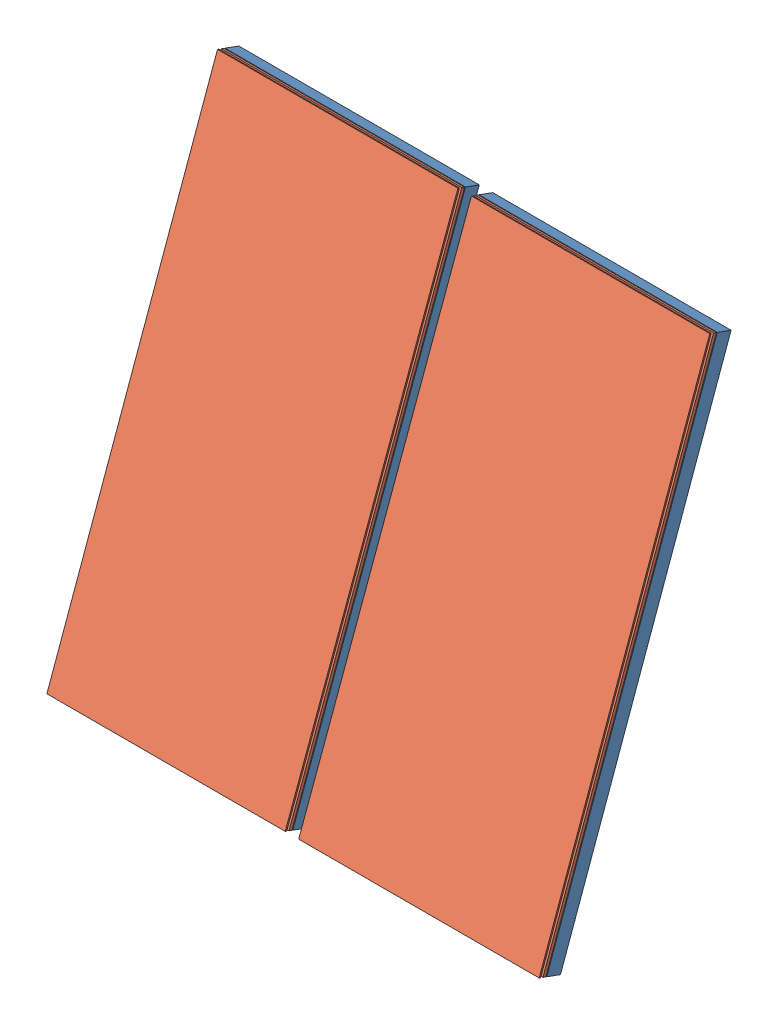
SolidWorks assembly Assem2.SLDASM, configuration Standard (file format 4400). Lengths in mm.
Overall size (3194 3181.3 2952.71).
6 component instances, 2 part files, 3 mates.
Components (placement in the parent):
- Assem1-1: Assem1.SLDASM [Standard] at origin size (1621.57 3104.27 1249.7)
  - Steelframe-1: Steelframe.SLDPRT [Standard] at origin size (1557 3086.49 1200.83)
  - Glass-1: Glass.sldprt [Default] at origin size (1557 3069.73 1154.79)
- Assem1-2: Assem1.SLDASM [Standard] at (-80 3053.9939 -1111.5629) x (-1 0 0) z (0 0.642788 0.766044) size (1621.57 3104.27 1249.7)
  - Steelframe-1: Steelframe.SLDPRT [Standard] at origin size (1557 3086.49 1200.83)
  - Glass-1: Glass.sldprt [Default] at origin size (1557 3069.73 1154.79)
Mates (geometry in assembly coordinates):
- Deckungsgleich2: coincident aligned: plane of ? through (7 3053.9939 -1111.5629) normal (0 0.939693 -0.34202); plane of ? through (-1637 3053.9939 -1111.5629) normal (0 0.939693 -0.34202)
- Deckungsgleich8: coincident anti-aligned: line of ? through (-40 0 20) axis (0 -0.939693 0.34202); line of ? through (-40 3066.8497 -1096.242) axis (0 0.939693 -0.34202)
- Winkel1: planar angle aligned: plane of ? through (-162.5214 -227.475 82.7941) normal (0 0.34202 0.939693); plane of ? through (82.5214 3281.4689 -1194.357) normal (0 0.34202 0.939693)
